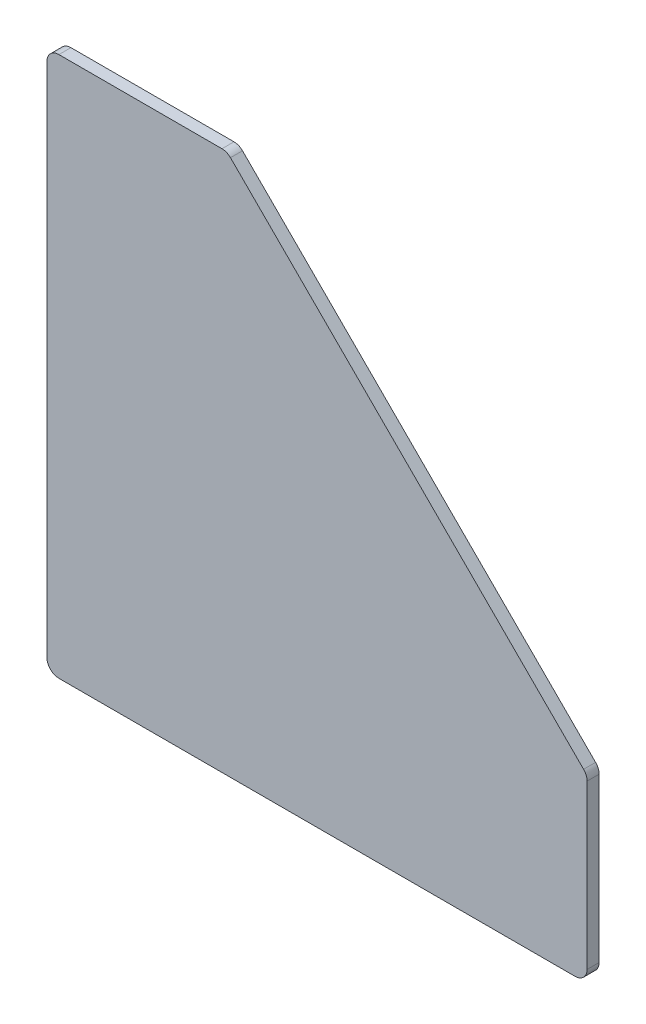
from build123d import *

# Parameters (mm, degrees)
BASE_EXTRUSION_DEPTH = 2


with BuildPart() as part:
    # Esquisse1 → Base-Extrusion (new body)
    with BuildSketch(Plane.XY):
        with BuildLine():
            Line((0, 88), (0, 2))
            ThreePointArc((0, 2), (0.585786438, 0.585786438), (2, 0))
            Line((2, 0), (88, 0))
            ThreePointArc((88, 0), (89.414213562, 0.585786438), (90, 2))
            Line((90, 2), (90, 29.171572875))
            ThreePointArc((90, 29.171572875), (89.847759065, 29.93693974), (89.414213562, 30.585786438))
            Line((89.414213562, 30.585786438), (30.585786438, 89.414213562))
            ThreePointArc((30.585786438, 89.414213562), (29.93693974, 89.847759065), (29.171572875, 90))
            Line((29.171572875, 90), (2, 90))
            ThreePointArc((2, 90), (0.585786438, 89.414213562), (0, 88))
        make_face()
    extrude(amount=BASE_EXTRUSION_DEPTH)


solid = part.part
